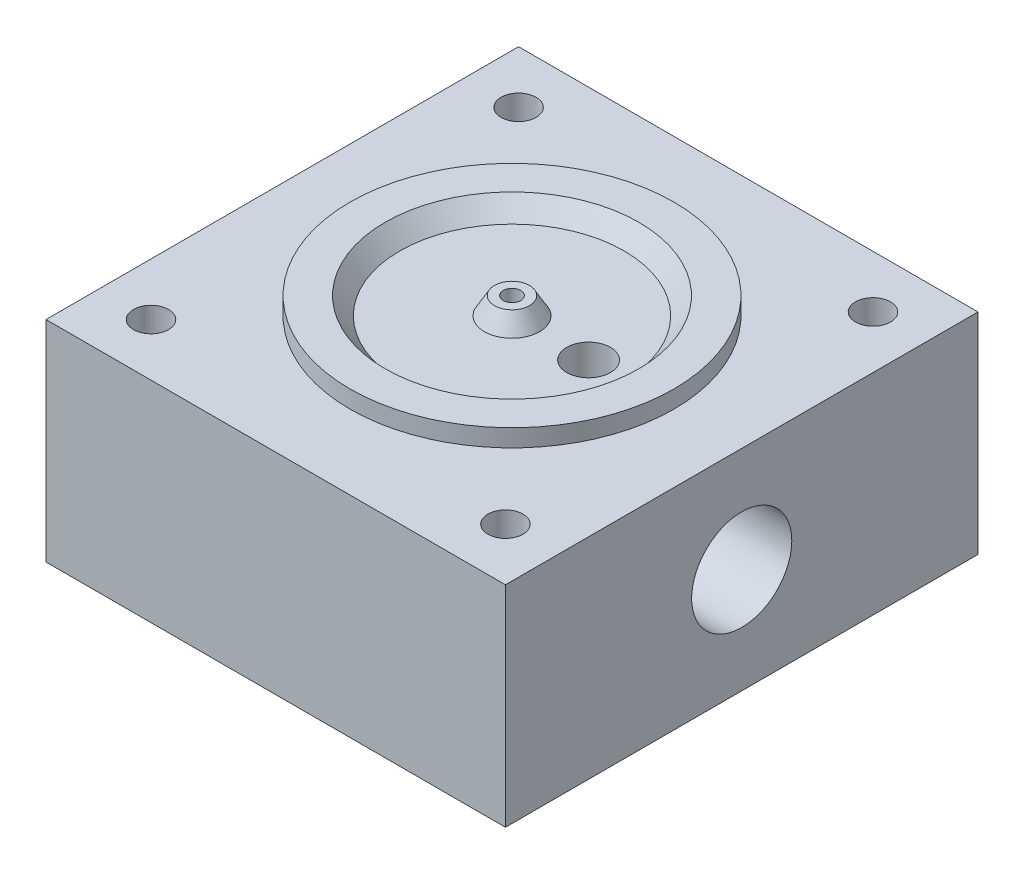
ISO-10303-21;
HEADER;
FILE_DESCRIPTION(('STEP AP214'),'2;1');
FILE_NAME('part.step','',(''),(''),'','','');
FILE_SCHEMA(('AUTOMOTIVE_DESIGN { 1 0 10303 214 1 1 1 1 }'));
ENDSEC;
DATA;
#1=APPLICATION_CONTEXT('core data for automotive mechanical design processes');
#2=APPLICATION_PROTOCOL_DEFINITION('international standard','automotive_design',2000,#1);
#3=PRODUCT_CONTEXT('',#1,'mechanical');
#4=PRODUCT('Part','Part','',(#3));
#5=PRODUCT_RELATED_PRODUCT_CATEGORY('part','',(#4));
#6=PRODUCT_DEFINITION_FORMATION('','',#4);
#7=PRODUCT_DEFINITION_CONTEXT('part definition',#1,'design');
#8=PRODUCT_DEFINITION('design','',#6,#7);
#9=PRODUCT_DEFINITION_SHAPE('','',#8);
#10=(LENGTH_UNIT() NAMED_UNIT(*) SI_UNIT(.MILLI.,.METRE.));
#11=(NAMED_UNIT(*) PLANE_ANGLE_UNIT() SI_UNIT($,.RADIAN.));
#12=(NAMED_UNIT(*) SI_UNIT($,.STERADIAN.) SOLID_ANGLE_UNIT());
#13=UNCERTAINTY_MEASURE_WITH_UNIT(LENGTH_MEASURE(1.E-05),#10,'distance_accuracy_value','');
#14=(GEOMETRIC_REPRESENTATION_CONTEXT(3) GLOBAL_UNCERTAINTY_ASSIGNED_CONTEXT((#13)) GLOBAL_UNIT_ASSIGNED_CONTEXT((#10,
#11,#12)) REPRESENTATION_CONTEXT('',''));
#15=CARTESIAN_POINT('',(0.,0.,0.));
#16=DIRECTION('',(0.,0.,1.));
#17=DIRECTION('',(1.,0.,0.));
#18=AXIS2_PLACEMENT_3D('',#15,#16,#17);
#19=CARTESIAN_POINT('',(0.,24.,-54.));
#20=DIRECTION('',(0.,1.,0.));
#21=DIRECTION('',(0.,0.,1.));
#22=AXIS2_PLACEMENT_3D('',#19,#20,#21);
#23=PLANE('',#22);
#24=CARTESIAN_POINT('',(46.5,24.,-48.));
#25=DIRECTION('',(0.,1.,0.));
#26=DIRECTION('',(0.,0.,-1.));
#27=AXIS2_PLACEMENT_3D('',#24,#25,#26);
#28=CIRCLE('',#27,2.);
#29=CARTESIAN_POINT('',(46.5,24.,-50.));
#30=VERTEX_POINT('',#29);
#31=EDGE_CURVE('E282',#30,#30,#28,.T.);
#32=ORIENTED_EDGE('',*,*,#31,.F.);
#33=EDGE_LOOP('',(#32));
#34=FACE_BOUND('',#33,.T.);
#35=CARTESIAN_POINT('',(6.,24.,-48.));
#36=DIRECTION('',(0.,-1.,0.));
#37=DIRECTION('',(0.,0.,-1.));
#38=AXIS2_PLACEMENT_3D('',#35,#36,#37);
#39=CIRCLE('',#38,2.);
#40=CARTESIAN_POINT('',(6.,24.,-50.));
#41=VERTEX_POINT('',#40);
#42=EDGE_CURVE('E292',#41,#41,#39,.T.);
#43=ORIENTED_EDGE('',*,*,#42,.T.);
#44=EDGE_LOOP('',(#43));
#45=FACE_BOUND('',#44,.T.);
#46=CARTESIAN_POINT('',(6.,24.,-6.));
#47=DIRECTION('',(0.,1.,0.));
#48=DIRECTION('',(0.,0.,1.));
#49=AXIS2_PLACEMENT_3D('',#46,#47,#48);
#50=CIRCLE('',#49,2.);
#51=CARTESIAN_POINT('',(6.,24.,-4.));
#52=VERTEX_POINT('',#51);
#53=EDGE_CURVE('E251',#52,#52,#50,.T.);
#54=ORIENTED_EDGE('',*,*,#53,.F.);
#55=EDGE_LOOP('',(#54));
#56=FACE_BOUND('',#55,.T.);
#57=DIRECTION('',(-1.,0.,0.));
#58=VECTOR('',#57,1.);
#59=CARTESIAN_POINT('',(0.,24.,0.));
#60=LINE('',#59,#58);
#61=CARTESIAN_POINT('',(52.5,24.,0.));
#62=VERTEX_POINT('',#61);
#63=CARTESIAN_POINT('',(0.,24.,0.));
#64=VERTEX_POINT('',#63);
#65=EDGE_CURVE('E120',#62,#64,#60,.T.);
#66=ORIENTED_EDGE('',*,*,#65,.F.);
#67=DIRECTION('',(0.,0.,1.));
#68=VECTOR('',#67,1.);
#69=CARTESIAN_POINT('',(52.5,24.,-54.));
#70=LINE('',#69,#68);
#71=CARTESIAN_POINT('',(52.5,24.,-54.));
#72=VERTEX_POINT('',#71);
#73=EDGE_CURVE('E40',#72,#62,#70,.T.);
#74=ORIENTED_EDGE('',*,*,#73,.F.);
#75=DIRECTION('',(-1.,0.,0.));
#76=VECTOR('',#75,1.);
#77=CARTESIAN_POINT('',(0.,24.,-54.));
#78=LINE('',#77,#76);
#79=CARTESIAN_POINT('',(0.,24.,-54.));
#80=VERTEX_POINT('',#79);
#81=EDGE_CURVE('E131',#72,#80,#78,.T.);
#82=ORIENTED_EDGE('',*,*,#81,.T.);
#83=DIRECTION('',(0.,0.,1.));
#84=VECTOR('',#83,1.);
#85=CARTESIAN_POINT('',(0.,24.,-54.));
#86=LINE('',#85,#84);
#87=EDGE_CURVE('E11',#80,#64,#86,.T.);
#88=ORIENTED_EDGE('',*,*,#87,.T.);
#89=EDGE_LOOP('',(#66,#74,#82,#88));
#90=FACE_BOUND('',#89,.T.);
#91=CARTESIAN_POINT('',(26.25,24.,-27.));
#92=DIRECTION('',(0.,1.,0.));
#93=DIRECTION('',(0.,0.,1.));
#94=AXIS2_PLACEMENT_3D('',#91,#92,#93);
#95=CIRCLE('',#94,18.5);
#96=CARTESIAN_POINT('',(26.25,24.,-8.5));
#97=VERTEX_POINT('',#96);
#98=EDGE_CURVE('E105',#97,#97,#95,.T.);
#99=ORIENTED_EDGE('',*,*,#98,.F.);
#100=EDGE_LOOP('',(#99));
#101=FACE_BOUND('',#100,.T.);
#102=CARTESIAN_POINT('',(46.5,24.,-6.));
#103=DIRECTION('',(0.,-1.,0.));
#104=DIRECTION('',(0.,0.,1.));
#105=AXIS2_PLACEMENT_3D('',#102,#103,#104);
#106=CIRCLE('',#105,2.);
#107=CARTESIAN_POINT('',(46.5,24.,-4.));
#108=VERTEX_POINT('',#107);
#109=EDGE_CURVE('E284',#108,#108,#106,.T.);
#110=ORIENTED_EDGE('',*,*,#109,.T.);
#111=EDGE_LOOP('',(#110));
#112=FACE_BOUND('',#111,.T.);
#113=ADVANCED_FACE('F31',(#34,#45,#56,#90,#101,#112),#23,.T.);
#114=CARTESIAN_POINT('',(0.,0.,-54.));
#115=DIRECTION('',(0.,-1.,0.));
#116=DIRECTION('',(0.,0.,-1.));
#117=AXIS2_PLACEMENT_3D('',#114,#115,#116);
#118=PLANE('',#117);
#119=CARTESIAN_POINT('',(46.5,0.,-48.));
#120=DIRECTION('',(0.,1.,0.));
#121=DIRECTION('',(0.,0.,-1.));
#122=AXIS2_PLACEMENT_3D('',#119,#120,#121);
#123=CIRCLE('',#122,2.);
#124=CARTESIAN_POINT('',(46.5,0.,-50.));
#125=VERTEX_POINT('',#124);
#126=EDGE_CURVE('E280',#125,#125,#123,.T.);
#127=ORIENTED_EDGE('',*,*,#126,.T.);
#128=EDGE_LOOP('',(#127));
#129=FACE_BOUND('',#128,.T.);
#130=CARTESIAN_POINT('',(6.,0.,-48.));
#131=DIRECTION('',(0.,-1.,0.));
#132=DIRECTION('',(0.,0.,-1.));
#133=AXIS2_PLACEMENT_3D('',#130,#131,#132);
#134=CIRCLE('',#133,2.);
#135=CARTESIAN_POINT('',(6.,0.,-50.));
#136=VERTEX_POINT('',#135);
#137=EDGE_CURVE('E295',#136,#136,#134,.T.);
#138=ORIENTED_EDGE('',*,*,#137,.F.);
#139=EDGE_LOOP('',(#138));
#140=FACE_BOUND('',#139,.T.);
#141=CARTESIAN_POINT('',(6.,0.,-6.));
#142=DIRECTION('',(0.,1.,0.));
#143=DIRECTION('',(0.,0.,1.));
#144=AXIS2_PLACEMENT_3D('',#141,#142,#143);
#145=CIRCLE('',#144,2.);
#146=CARTESIAN_POINT('',(6.,0.,-4.));
#147=VERTEX_POINT('',#146);
#148=EDGE_CURVE('E248',#147,#147,#145,.T.);
#149=ORIENTED_EDGE('',*,*,#148,.T.);
#150=EDGE_LOOP('',(#149));
#151=FACE_BOUND('',#150,.T.);
#152=DIRECTION('',(1.,0.,0.));
#153=VECTOR('',#152,1.);
#154=CARTESIAN_POINT('',(0.,0.,0.));
#155=LINE('',#154,#153);
#156=CARTESIAN_POINT('',(0.,0.,0.));
#157=VERTEX_POINT('',#156);
#158=CARTESIAN_POINT('',(52.5,0.,0.));
#159=VERTEX_POINT('',#158);
#160=EDGE_CURVE('E114',#157,#159,#155,.T.);
#161=ORIENTED_EDGE('',*,*,#160,.F.);
#162=DIRECTION('',(0.,0.,1.));
#163=VECTOR('',#162,1.);
#164=CARTESIAN_POINT('',(0.,0.,-54.));
#165=LINE('',#164,#163);
#166=CARTESIAN_POINT('',(0.,0.,-54.));
#167=VERTEX_POINT('',#166);
#168=EDGE_CURVE('E35',#167,#157,#165,.T.);
#169=ORIENTED_EDGE('',*,*,#168,.F.);
#170=DIRECTION('',(1.,0.,0.));
#171=VECTOR('',#170,1.);
#172=CARTESIAN_POINT('',(0.,0.,-54.));
#173=LINE('',#172,#171);
#174=CARTESIAN_POINT('',(52.5,0.,-54.));
#175=VERTEX_POINT('',#174);
#176=EDGE_CURVE('E125',#167,#175,#173,.T.);
#177=ORIENTED_EDGE('',*,*,#176,.T.);
#178=DIRECTION('',(0.,0.,1.));
#179=VECTOR('',#178,1.);
#180=CARTESIAN_POINT('',(52.5,0.,-54.));
#181=LINE('',#180,#179);
#182=EDGE_CURVE('E134',#175,#159,#181,.T.);
#183=ORIENTED_EDGE('',*,*,#182,.T.);
#184=EDGE_LOOP('',(#161,#169,#177,#183));
#185=FACE_BOUND('',#184,.T.);
#186=CARTESIAN_POINT('',(46.5,0.,-6.));
#187=DIRECTION('',(0.,-1.,0.));
#188=DIRECTION('',(0.,0.,1.));
#189=AXIS2_PLACEMENT_3D('',#186,#187,#188);
#190=CIRCLE('',#189,2.);
#191=CARTESIAN_POINT('',(46.5,0.,-4.));
#192=VERTEX_POINT('',#191);
#193=EDGE_CURVE('E289',#192,#192,#190,.T.);
#194=ORIENTED_EDGE('',*,*,#193,.F.);
#195=EDGE_LOOP('',(#194));
#196=FACE_BOUND('',#195,.T.);
#197=ADVANCED_FACE('F139',(#129,#140,#151,#185,#196),#118,.T.);
#198=CARTESIAN_POINT('',(26.25,26.,-27.));
#199=DIRECTION('',(0.,1.,0.));
#200=DIRECTION('',(0.,0.,1.));
#201=AXIS2_PLACEMENT_3D('',#198,#199,#200);
#202=PLANE('',#201);
#203=CARTESIAN_POINT('',(26.25,26.,-27.));
#204=DIRECTION('',(0.,1.,0.));
#205=DIRECTION('',(0.,0.,1.));
#206=AXIS2_PLACEMENT_3D('',#203,#204,#205);
#207=CIRCLE('',#206,18.5);
#208=CARTESIAN_POINT('',(26.25,26.,-8.5));
#209=VERTEX_POINT('',#208);
#210=EDGE_CURVE('E108',#209,#209,#207,.T.);
#211=ORIENTED_EDGE('',*,*,#210,.T.);
#212=EDGE_LOOP('',(#211));
#213=FACE_BOUND('',#212,.T.);
#214=CARTESIAN_POINT('',(26.25,26.,-27.));
#215=DIRECTION('',(0.,1.,0.));
#216=DIRECTION('',(0.,0.,1.));
#217=AXIS2_PLACEMENT_3D('',#214,#215,#216);
#218=CIRCLE('',#217,14.5);
#219=CARTESIAN_POINT('',(26.25,26.,-12.5));
#220=VERTEX_POINT('',#219);
#221=EDGE_CURVE('E90',#220,#220,#218,.T.);
#222=ORIENTED_EDGE('',*,*,#221,.F.);
#223=EDGE_LOOP('',(#222));
#224=FACE_BOUND('',#223,.T.);
#225=ADVANCED_FACE('F160',(#213,#224),#202,.T.);
#226=CARTESIAN_POINT('',(0.,0.,-54.));
#227=DIRECTION('',(-1.,0.,0.));
#228=DIRECTION('',(0.,0.,1.));
#229=AXIS2_PLACEMENT_3D('',#226,#227,#228);
#230=PLANE('',#229);
#231=CARTESIAN_POINT('',(0.,12.,-27.));
#232=DIRECTION('',(-1.,0.,0.));
#233=DIRECTION('',(0.,0.,1.));
#234=AXIS2_PLACEMENT_3D('',#231,#232,#233);
#235=CIRCLE('',#234,5.7225);
#236=CARTESIAN_POINT('',(0.,12.,-21.2775));
#237=VERTEX_POINT('',#236);
#238=EDGE_CURVE('E239',#237,#237,#235,.T.);
#239=ORIENTED_EDGE('',*,*,#238,.F.);
#240=EDGE_LOOP('',(#239));
#241=FACE_BOUND('',#240,.T.);
#242=DIRECTION('',(0.,-1.,0.));
#243=VECTOR('',#242,1.);
#244=CARTESIAN_POINT('',(0.,0.,0.));
#245=LINE('',#244,#243);
#246=EDGE_CURVE('E111',#64,#157,#245,.T.);
#247=ORIENTED_EDGE('',*,*,#246,.F.);
#248=ORIENTED_EDGE('',*,*,#87,.F.);
#249=DIRECTION('',(0.,-1.,0.));
#250=VECTOR('',#249,1.);
#251=CARTESIAN_POINT('',(0.,0.,-54.));
#252=LINE('',#251,#250);
#253=EDGE_CURVE('E123',#80,#167,#252,.T.);
#254=ORIENTED_EDGE('',*,*,#253,.T.);
#255=ORIENTED_EDGE('',*,*,#168,.T.);
#256=EDGE_LOOP('',(#247,#248,#254,#255));
#257=FACE_BOUND('',#256,.T.);
#258=ADVANCED_FACE('F33',(#241,#257),#230,.T.);
#259=CARTESIAN_POINT('',(52.5,0.,-54.));
#260=DIRECTION('',(1.,0.,0.));
#261=DIRECTION('',(0.,0.,-1.));
#262=AXIS2_PLACEMENT_3D('',#259,#260,#261);
#263=PLANE('',#262);
#264=CARTESIAN_POINT('',(52.5,12.,-27.));
#265=DIRECTION('',(1.,0.,0.));
#266=DIRECTION('',(0.,0.,-1.));
#267=AXIS2_PLACEMENT_3D('',#264,#265,#266);
#268=CIRCLE('',#267,5.7225);
#269=CARTESIAN_POINT('',(52.5,12.,-32.7225));
#270=VERTEX_POINT('',#269);
#271=EDGE_CURVE('E233',#270,#270,#268,.T.);
#272=ORIENTED_EDGE('',*,*,#271,.F.);
#273=EDGE_LOOP('',(#272));
#274=FACE_BOUND('',#273,.T.);
#275=DIRECTION('',(0.,1.,0.));
#276=VECTOR('',#275,1.);
#277=CARTESIAN_POINT('',(52.5,0.,0.));
#278=LINE('',#277,#276);
#279=EDGE_CURVE('E117',#159,#62,#278,.T.);
#280=ORIENTED_EDGE('',*,*,#279,.F.);
#281=ORIENTED_EDGE('',*,*,#182,.F.);
#282=DIRECTION('',(0.,1.,0.));
#283=VECTOR('',#282,1.);
#284=CARTESIAN_POINT('',(52.5,0.,-54.));
#285=LINE('',#284,#283);
#286=EDGE_CURVE('E128',#175,#72,#285,.T.);
#287=ORIENTED_EDGE('',*,*,#286,.T.);
#288=ORIENTED_EDGE('',*,*,#73,.T.);
#289=EDGE_LOOP('',(#280,#281,#287,#288));
#290=FACE_BOUND('',#289,.T.);
#291=ADVANCED_FACE('F151',(#274,#290),#263,.T.);
#292=CARTESIAN_POINT('',(0.,24.,-54.));
#293=DIRECTION('',(0.,0.,-1.));
#294=DIRECTION('',(-1.,0.,0.));
#295=AXIS2_PLACEMENT_3D('',#292,#293,#294);
#296=PLANE('',#295);
#297=ORIENTED_EDGE('',*,*,#253,.F.);
#298=ORIENTED_EDGE('',*,*,#81,.F.);
#299=ORIENTED_EDGE('',*,*,#286,.F.);
#300=ORIENTED_EDGE('',*,*,#176,.F.);
#301=EDGE_LOOP('',(#297,#298,#299,#300));
#302=FACE_BOUND('',#301,.T.);
#303=ADVANCED_FACE('F149',(#302),#296,.T.);
#304=CARTESIAN_POINT('',(0.,24.,0.));
#305=DIRECTION('',(0.,0.,-1.));
#306=DIRECTION('',(-1.,0.,0.));
#307=AXIS2_PLACEMENT_3D('',#304,#305,#306);
#308=PLANE('',#307);
#309=ORIENTED_EDGE('',*,*,#246,.T.);
#310=ORIENTED_EDGE('',*,*,#160,.T.);
#311=ORIENTED_EDGE('',*,*,#279,.T.);
#312=ORIENTED_EDGE('',*,*,#65,.T.);
#313=EDGE_LOOP('',(#309,#310,#311,#312));
#314=FACE_BOUND('',#313,.T.);
#315=ADVANCED_FACE('F142',(#314),#308,.F.);
#316=CARTESIAN_POINT('',(26.25,26.,-27.));
#317=DIRECTION('',(0.,-1.,0.));
#318=DIRECTION('',(0.,0.,-1.));
#319=AXIS2_PLACEMENT_3D('',#316,#317,#318);
#320=CYLINDRICAL_SURFACE('',#319,18.5);
#321=ORIENTED_EDGE('',*,*,#210,.F.);
#322=EDGE_LOOP('',(#321));
#323=FACE_BOUND('',#322,.T.);
#324=ORIENTED_EDGE('',*,*,#98,.T.);
#325=EDGE_LOOP('',(#324));
#326=FACE_BOUND('',#325,.T.);
#327=ADVANCED_FACE('F175',(#323,#326),#320,.T.);
#328=CARTESIAN_POINT('',(39.0718007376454,24.,-27.));
#329=DIRECTION('',(0.,1.,0.));
#330=DIRECTION('',(0.,0.,1.));
#331=AXIS2_PLACEMENT_3D('',#328,#329,#330);
#332=PLANE('',#331);
#333=CARTESIAN_POINT('',(35.,24.,-27.));
#334=DIRECTION('',(0.,1.,0.));
#335=DIRECTION('',(0.,0.,1.));
#336=AXIS2_PLACEMENT_3D('',#333,#334,#335);
#337=CIRCLE('',#336,2.5);
#338=CARTESIAN_POINT('',(35.,24.,-24.5));
#339=VERTEX_POINT('',#338);
#340=EDGE_CURVE('E229',#339,#339,#337,.T.);
#341=ORIENTED_EDGE('',*,*,#340,.F.);
#342=EDGE_LOOP('',(#341));
#343=FACE_BOUND('',#342,.T.);
#344=CARTESIAN_POINT('',(26.25,24.,-27.));
#345=DIRECTION('',(0.,1.,0.));
#346=DIRECTION('',(0.,0.,1.));
#347=AXIS2_PLACEMENT_3D('',#344,#345,#346);
#348=CIRCLE('',#347,12.8218007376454);
#349=CARTESIAN_POINT('',(26.25,24.,-14.1781992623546));
#350=VERTEX_POINT('',#349);
#351=EDGE_CURVE('E86',#350,#350,#348,.T.);
#352=ORIENTED_EDGE('',*,*,#351,.T.);
#353=EDGE_LOOP('',(#352));
#354=FACE_BOUND('',#353,.T.);
#355=CARTESIAN_POINT('',(26.25,24.,-27.));
#356=DIRECTION('',(0.,1.,0.));
#357=DIRECTION('',(0.,0.,1.));
#358=AXIS2_PLACEMENT_3D('',#355,#356,#357);
#359=CIRCLE('',#358,3.15470053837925);
#360=CARTESIAN_POINT('',(26.25,24.,-23.8452994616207));
#361=VERTEX_POINT('',#360);
#362=EDGE_CURVE('E102',#361,#361,#359,.T.);
#363=ORIENTED_EDGE('',*,*,#362,.F.);
#364=EDGE_LOOP('',(#363));
#365=FACE_BOUND('',#364,.T.);
#366=ADVANCED_FACE('F178',(#343,#354,#365),#332,.T.);
#367=CARTESIAN_POINT('',(26.25,26.,-27.));
#368=DIRECTION('',(0.,-1.,0.));
#369=DIRECTION('',(0.,0.,-1.));
#370=AXIS2_PLACEMENT_3D('',#367,#368,#369);
#371=CONICAL_SURFACE('',#370,2.,0.523598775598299);
#372=ORIENTED_EDGE('',*,*,#362,.T.);
#373=EDGE_LOOP('',(#372));
#374=FACE_BOUND('',#373,.T.);
#375=CARTESIAN_POINT('',(26.25,26.,-27.));
#376=DIRECTION('',(0.,1.,0.));
#377=DIRECTION('',(0.,0.,1.));
#378=AXIS2_PLACEMENT_3D('',#375,#376,#377);
#379=CIRCLE('',#378,2.);
#380=CARTESIAN_POINT('',(26.25,26.,-25.));
#381=VERTEX_POINT('',#380);
#382=EDGE_CURVE('E99',#381,#381,#379,.T.);
#383=ORIENTED_EDGE('',*,*,#382,.F.);
#384=EDGE_LOOP('',(#383));
#385=FACE_BOUND('',#384,.T.);
#386=ADVANCED_FACE('F186',(#374,#385),#371,.T.);
#387=CARTESIAN_POINT('',(26.25,24.,-27.));
#388=DIRECTION('',(0.,1.,0.));
#389=DIRECTION('',(0.,0.,1.));
#390=AXIS2_PLACEMENT_3D('',#387,#388,#389);
#391=CONICAL_SURFACE('',#390,12.8218007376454,0.698131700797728);
#392=ORIENTED_EDGE('',*,*,#221,.T.);
#393=EDGE_LOOP('',(#392));
#394=FACE_BOUND('',#393,.T.);
#395=ORIENTED_EDGE('',*,*,#351,.F.);
#396=EDGE_LOOP('',(#395));
#397=FACE_BOUND('',#396,.T.);
#398=ADVANCED_FACE('F182',(#394,#397),#391,.F.);
#399=CARTESIAN_POINT('',(26.25,26.,-27.));
#400=DIRECTION('',(0.,1.,0.));
#401=DIRECTION('',(0.,0.,1.));
#402=AXIS2_PLACEMENT_3D('',#399,#400,#401);
#403=CIRCLE('',#402,1.);
#404=CARTESIAN_POINT('',(26.25,26.,-26.));
#405=VERTEX_POINT('',#404);
#406=EDGE_CURVE('E228',#405,#405,#403,.T.);
#407=ORIENTED_EDGE('',*,*,#406,.F.);
#408=EDGE_LOOP('',(#407));
#409=FACE_BOUND('',#408,.T.);
#410=ORIENTED_EDGE('',*,*,#382,.T.);
#411=EDGE_LOOP('',(#410));
#412=FACE_BOUND('',#411,.T.);
#413=ADVANCED_FACE('F80',(#409,#412),#202,.T.);
#414=CARTESIAN_POINT('',(27.5,12.,-27.));
#415=DIRECTION('',(-1.,0.,0.));
#416=DIRECTION('',(0.,0.,1.));
#417=AXIS2_PLACEMENT_3D('',#414,#415,#416);
#418=CONICAL_SURFACE('',#417,2.,1.02974425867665);
#419=CARTESIAN_POINT('',(28.7017212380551,12.,-27.));
#420=VERTEX_POINT('',#419);
#421=VERTEX_LOOP('',#420);
#422=FACE_BOUND('',#421,.T.);
#423=CARTESIAN_POINT('',(27.5,12.,-27.));
#424=DIRECTION('',(-1.,0.,0.));
#425=DIRECTION('',(0.,0.,1.));
#426=AXIS2_PLACEMENT_3D('',#423,#424,#425);
#427=CIRCLE('',#426,2.);
#428=CARTESIAN_POINT('',(27.5,12.,-25.));
#429=VERTEX_POINT('',#428);
#430=EDGE_CURVE('E84',#429,#429,#427,.T.);
#431=ORIENTED_EDGE('',*,*,#430,.T.);
#432=EDGE_LOOP('',(#431));
#433=FACE_BOUND('',#432,.T.);
#434=ADVANCED_FACE('F76',(#422,#433),#418,.F.);
#435=CARTESIAN_POINT('',(0.,12.,-27.));
#436=DIRECTION('',(-1.,0.,0.));
#437=DIRECTION('',(0.,0.,1.));
#438=AXIS2_PLACEMENT_3D('',#435,#436,#437);
#439=CYLINDRICAL_SURFACE('',#438,2.);
#440=CARTESIAN_POINT('',(26.25,13.7320508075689,-26.));
#441=CARTESIAN_POINT('',(26.1978921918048,13.7320553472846,-26.0000036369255));
#442=CARTESIAN_POINT('',(26.145718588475,13.7344380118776,-26.0041000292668));
#443=CARTESIAN_POINT('',(26.0429727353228,13.7436236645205,-26.0202767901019));
#444=CARTESIAN_POINT('',(25.9924040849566,13.7504359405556,-26.0323739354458));
#445=CARTESIAN_POINT('',(25.8945483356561,13.767493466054,-26.0639000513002));
#446=CARTESIAN_POINT('',(25.8472453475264,13.7777204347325,-26.0832900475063));
#447=CARTESIAN_POINT('',(25.7565757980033,13.8004266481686,-26.1287324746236));
#448=CARTESIAN_POINT('',(25.7132094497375,13.8129060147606,-26.1547852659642));
#449=CARTESIAN_POINT('',(25.6276942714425,13.8399686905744,-26.2153334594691));
#450=CARTESIAN_POINT('',(25.5859408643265,13.8546406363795,-26.2503479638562));
#451=CARTESIAN_POINT('',(25.5085916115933,13.8837198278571,-26.3267461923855));
#452=CARTESIAN_POINT('',(25.4729988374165,13.8981269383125,-26.3681330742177));
#453=CARTESIAN_POINT('',(25.4066328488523,13.9262147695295,-26.4595104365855));
#454=CARTESIAN_POINT('',(25.3763462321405,13.9397810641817,-26.5098928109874));
#455=CARTESIAN_POINT('',(25.3248591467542,13.9635075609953,-26.6158429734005));
#456=CARTESIAN_POINT('',(25.3036529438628,13.9736699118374,-26.6714074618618));
#457=CARTESIAN_POINT('',(25.2724953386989,13.9888046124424,-26.781955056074));
#458=CARTESIAN_POINT('',(25.2618504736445,13.9940948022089,-26.8366982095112));
#459=CARTESIAN_POINT('',(25.249833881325,14.0000758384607,-26.9474293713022));
#460=CARTESIAN_POINT('',(25.2484565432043,14.0007694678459,-27.0034166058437));
#461=CARTESIAN_POINT('',(25.2547466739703,13.9976298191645,-27.1098325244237));
#462=CARTESIAN_POINT('',(25.2616380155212,13.9941849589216,-27.1603211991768));
#463=CARTESIAN_POINT('',(25.2828808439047,13.9837424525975,-27.2593137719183));
#464=CARTESIAN_POINT('',(25.2972328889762,13.9767445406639,-27.3078175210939));
#465=CARTESIAN_POINT('',(25.3330825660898,13.9597158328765,-27.4023093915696));
#466=CARTESIAN_POINT('',(25.3546763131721,13.949644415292,-27.4482534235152));
#467=CARTESIAN_POINT('',(25.4042634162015,13.9273764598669,-27.5359768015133));
#468=CARTESIAN_POINT('',(25.4322590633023,13.9151791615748,-27.5777546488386));
#469=CARTESIAN_POINT('',(25.496895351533,13.8884439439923,-27.6601736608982));
#470=CARTESIAN_POINT('',(25.534103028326,13.8737937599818,-27.7003340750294));
#471=CARTESIAN_POINT('',(25.6145897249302,13.8445434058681,-27.7741043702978));
#472=CARTESIAN_POINT('',(25.6578733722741,13.8299432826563,-27.8077092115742));
#473=CARTESIAN_POINT('',(25.7526481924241,13.8014415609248,-27.8695053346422));
#474=CARTESIAN_POINT('',(25.8044860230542,13.7876431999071,-27.8972173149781));
#475=CARTESIAN_POINT('',(25.912937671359,13.7637545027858,-27.9433191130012));
#476=CARTESIAN_POINT('',(25.9695464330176,13.7536603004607,-27.9617186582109));
#477=CARTESIAN_POINT('',(26.0812145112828,13.7394463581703,-27.987180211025));
#478=CARTESIAN_POINT('',(26.1360411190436,13.734916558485,-27.99502512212));
#479=CARTESIAN_POINT('',(26.2464013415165,13.7311791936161,-28.0015169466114));
#480=CARTESIAN_POINT('',(26.3019344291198,13.7319678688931,-28.000170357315));
#481=CARTESIAN_POINT('',(26.4056539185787,13.7383433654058,-27.989036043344));
#482=CARTESIAN_POINT('',(26.4539794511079,13.7433958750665,-27.9801878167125));
#483=CARTESIAN_POINT('',(26.548367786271,13.7569402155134,-27.9556962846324));
#484=CARTESIAN_POINT('',(26.5944298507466,13.7654331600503,-27.9400507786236));
#485=CARTESIAN_POINT('',(26.6854113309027,13.7853622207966,-27.9016475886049));
#486=CARTESIAN_POINT('',(26.7301790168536,13.7969164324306,-27.8785940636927));
#487=CARTESIAN_POINT('',(26.815469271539,13.8215611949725,-27.8262870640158));
#488=CARTESIAN_POINT('',(26.8559896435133,13.8346525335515,-27.7970304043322));
#489=CARTESIAN_POINT('',(26.9369787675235,13.8628799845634,-27.7288371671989));
#490=CARTESIAN_POINT('',(26.9767971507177,13.8780658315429,-27.689145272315));
#491=CARTESIAN_POINT('',(27.0494122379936,13.9073423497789,-27.6034044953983));
#492=CARTESIAN_POINT('',(27.0822065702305,13.9214326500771,-27.5573534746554));
#493=CARTESIAN_POINT('',(27.1405737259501,13.9474136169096,-27.4585353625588));
#494=CARTESIAN_POINT('',(27.1659331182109,13.9592364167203,-27.4056230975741));
#495=CARTESIAN_POINT('',(27.2071379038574,13.978833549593,-27.2955223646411));
#496=CARTESIAN_POINT('',(27.2229916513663,13.9866114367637,-27.2383377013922));
#497=CARTESIAN_POINT('',(27.2433685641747,13.9966750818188,-27.1269796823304));
#498=CARTESIAN_POINT('',(27.2487978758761,13.9993992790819,-27.0730114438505));
#499=CARTESIAN_POINT('',(27.2508432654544,14.0004213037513,-26.9648740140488));
#500=CARTESIAN_POINT('',(27.2474624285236,13.9987206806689,-26.9107048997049));
#501=CARTESIAN_POINT('',(27.2325835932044,13.9913396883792,-26.8074620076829));
#502=CARTESIAN_POINT('',(27.2216351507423,13.9859289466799,-26.7582876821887));
#503=CARTESIAN_POINT('',(27.192673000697,13.9719209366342,-26.6625540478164));
#504=CARTESIAN_POINT('',(27.1746582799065,13.963323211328,-26.6159951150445));
#505=CARTESIAN_POINT('',(27.131272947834,13.9432593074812,-26.5245765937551));
#506=CARTESIAN_POINT('',(27.1056206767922,13.931686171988,-26.4798748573));
#507=CARTESIAN_POINT('',(27.048042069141,13.9068813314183,-26.395225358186));
#508=CARTESIAN_POINT('',(27.0161128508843,13.8936488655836,-26.3552797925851));
#509=CARTESIAN_POINT('',(26.9432028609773,13.8652861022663,-26.2770859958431));
#510=CARTESIAN_POINT('',(26.9016375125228,13.850097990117,-26.2394023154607));
#511=CARTESIAN_POINT('',(26.8125492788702,13.8206307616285,-26.1713367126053));
#512=CARTESIAN_POINT('',(26.7650211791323,13.8063524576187,-26.1409612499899));
#513=CARTESIAN_POINT('',(26.663363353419,13.7799960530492,-26.0875689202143));
#514=CARTESIAN_POINT('',(26.6090724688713,13.7680017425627,-26.0648149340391));
#515=CARTESIAN_POINT('',(26.4966675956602,13.7486615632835,-26.0291212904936));
#516=CARTESIAN_POINT('',(26.4385671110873,13.741300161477,-26.0161488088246));
#517=CARTESIAN_POINT('',(26.358194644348,13.7352927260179,-26.0056329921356));
#518=CARTESIAN_POINT('',(26.3366321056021,13.7340812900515,-26.0035238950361));
#519=CARTESIAN_POINT('',(26.2933835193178,13.7324593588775,-26.00070659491));
#520=CARTESIAN_POINT('',(26.2716974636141,13.7320489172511,-25.9999984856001));
#521=CARTESIAN_POINT('',(26.25,13.7320508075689,-26.));
#522=B_SPLINE_CURVE_WITH_KNOTS('',3,(#440,#441,#442,#443,#444,#445,#446,#447,#448,#449,#450,
#451,#452,#453,#454,#455,#456,#457,#458,#459,#460,#461,#462,#463,#464,#465,#466,#467,#468,#469,
#470,#471,#472,#473,#474,#475,#476,#477,#478,#479,#480,#481,#482,#483,#484,#485,#486,#487,#488,
#489,#490,#491,#492,#493,#494,#495,#496,#497,#498,#499,#500,#501,#502,#503,#504,#505,#506,#507,
#508,#509,#510,#511,#512,#513,#514,#515,#516,#517,#518,#519,#520,#521),.UNSPECIFIED.,.T.,.F.,(4,
2,2,2,2,2,2,2,2,2,2,2,2,2,2,2,2,2,2,2,2,2,2,2,2,2,2,2,2,2,2,2,2,2,2,2,2,2,2,2,4),(0.,
0.156232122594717,0.312792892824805,0.468528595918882,0.624272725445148,0.792862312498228,
0.961535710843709,1.14157892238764,1.32150826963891,1.48863484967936,1.6556602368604,
1.80816097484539,1.96067312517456,2.11529534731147,2.26997299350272,2.43927191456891,
2.60870048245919,2.78888841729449,2.96888774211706,3.13462290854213,3.30024093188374,
3.44774183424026,3.59529052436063,3.74967296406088,3.90413486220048,4.07806743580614,
4.25205864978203,4.43064181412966,4.60906779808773,4.77112270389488,4.93312086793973,
5.08444424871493,5.23578933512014,5.39360750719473,5.5514983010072,5.72510241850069,
5.89885942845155,6.07810749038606,6.25675133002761,6.3218013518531,6.38685572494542),.UNSPECIFIED.);
#523=CARTESIAN_POINT('',(26.25,13.7320508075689,-26.));
#524=VERTEX_POINT('',#523);
#525=EDGE_CURVE('E222',#524,#524,#522,.T.);
#526=ORIENTED_EDGE('',*,*,#525,.F.);
#527=EDGE_LOOP('',(#526));
#528=FACE_BOUND('',#527,.T.);
#529=ORIENTED_EDGE('',*,*,#430,.F.);
#530=EDGE_LOOP('',(#529));
#531=FACE_BOUND('',#530,.T.);
#532=CARTESIAN_POINT('',(17.5,12.,-27.));
#533=DIRECTION('',(-1.,0.,0.));
#534=DIRECTION('',(0.,0.,1.));
#535=AXIS2_PLACEMENT_3D('',#532,#533,#534);
#536=CIRCLE('',#535,2.);
#537=CARTESIAN_POINT('',(17.5,12.,-25.));
#538=VERTEX_POINT('',#537);
#539=EDGE_CURVE('E87',#538,#538,#536,.T.);
#540=ORIENTED_EDGE('',*,*,#539,.T.);
#541=EDGE_LOOP('',(#540));
#542=FACE_BOUND('',#541,.T.);
#543=ADVANCED_FACE('F79',(#528,#531,#542),#439,.F.);
#544=CARTESIAN_POINT('',(17.5,14.,-27.));
#545=DIRECTION('',(1.,0.,0.));
#546=DIRECTION('',(0.,0.,-1.));
#547=AXIS2_PLACEMENT_3D('',#544,#545,#546);
#548=PLANE('',#547);
#549=ORIENTED_EDGE('',*,*,#539,.F.);
#550=EDGE_LOOP('',(#549));
#551=FACE_BOUND('',#550,.T.);
#552=CARTESIAN_POINT('',(17.5,12.,-27.));
#553=DIRECTION('',(-1.,0.,0.));
#554=DIRECTION('',(0.,0.,1.));
#555=AXIS2_PLACEMENT_3D('',#552,#553,#554);
#556=CIRCLE('',#555,5.7225);
#557=CARTESIAN_POINT('',(17.5,12.,-21.2775));
#558=VERTEX_POINT('',#557);
#559=EDGE_CURVE('E93',#558,#558,#556,.T.);
#560=ORIENTED_EDGE('',*,*,#559,.T.);
#561=EDGE_LOOP('',(#560));
#562=FACE_BOUND('',#561,.T.);
#563=ADVANCED_FACE('F196',(#551,#562),#548,.F.);
#564=CARTESIAN_POINT('',(0.,12.,-27.));
#565=DIRECTION('',(-1.,0.,0.));
#566=DIRECTION('',(0.,0.,1.));
#567=AXIS2_PLACEMENT_3D('',#564,#565,#566);
#568=CYLINDRICAL_SURFACE('',#567,5.7225);
#569=ORIENTED_EDGE('',*,*,#559,.F.);
#570=EDGE_LOOP('',(#569));
#571=FACE_BOUND('',#570,.T.);
#572=ORIENTED_EDGE('',*,*,#238,.T.);
#573=EDGE_LOOP('',(#572));
#574=FACE_BOUND('',#573,.T.);
#575=ADVANCED_FACE('F200',(#571,#574),#568,.F.);
#576=CARTESIAN_POINT('',(32.5,12.,-27.));
#577=DIRECTION('',(1.,0.,0.));
#578=DIRECTION('',(0.,0.,-1.));
#579=AXIS2_PLACEMENT_3D('',#576,#577,#578);
#580=CYLINDRICAL_SURFACE('',#579,5.7225);
#581=CARTESIAN_POINT('',(32.5,12.,-27.));
#582=DIRECTION('',(1.,0.,0.));
#583=DIRECTION('',(0.,0.,-1.));
#584=AXIS2_PLACEMENT_3D('',#581,#582,#583);
#585=CIRCLE('',#584,5.7225);
#586=CARTESIAN_POINT('',(32.5,17.7225,-27.));
#587=VERTEX_POINT('',#586);
#588=EDGE_CURVE('E236',#587,#587,#585,.T.);
#589=ORIENTED_EDGE('',*,*,#588,.F.);
#590=CARTESIAN_POINT('',(35.,17.1475242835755,-24.5));
#591=CARTESIAN_POINT('',(34.8673556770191,17.1475315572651,-24.5000068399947));
#592=CARTESIAN_POINT('',(34.7344870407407,17.1527258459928,-24.5106242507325));
#593=CARTESIAN_POINT('',(34.4726446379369,17.1728087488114,-24.5526399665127));
#594=CARTESIAN_POINT('',(34.3436818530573,17.1877224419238,-24.5840920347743));
#595=CARTESIAN_POINT('',(34.0939054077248,17.2252098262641,-24.6662904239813));
#596=CARTESIAN_POINT('',(33.9730589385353,17.2477501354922,-24.7169527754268));
#597=CARTESIAN_POINT('',(33.7416129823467,17.2979006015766,-24.8358823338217));
#598=CARTESIAN_POINT('',(33.6310117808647,17.3255099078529,-24.90414658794));
#599=CARTESIAN_POINT('',(33.4155502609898,17.3848019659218,-25.0613437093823));
#600=CARTESIAN_POINT('',(33.3114753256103,17.4166312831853,-25.151298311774));
#601=CARTESIAN_POINT('',(33.1193010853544,17.4795782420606,-25.3471815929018));
#602=CARTESIAN_POINT('',(33.0312083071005,17.5106955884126,-25.4531167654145));
#603=CARTESIAN_POINT('',(32.8693495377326,17.5705244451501,-25.6842590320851));
#604=CARTESIAN_POINT('',(32.7964860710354,17.5990459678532,-25.8101518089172));
#605=CARTESIAN_POINT('',(32.6733168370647,17.6486520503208,-26.0738816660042));
#606=CARTESIAN_POINT('',(32.6230001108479,17.6697402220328,-26.2117129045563));
#607=CARTESIAN_POINT('',(32.5492578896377,17.7010607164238,-26.48714297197));
#608=CARTESIAN_POINT('',(32.5244728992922,17.7118393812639,-26.6243143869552));
#609=CARTESIAN_POINT('',(32.4980856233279,17.7233234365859,-26.9012634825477));
#610=CARTESIAN_POINT('',(32.4964729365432,17.7240333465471,-27.0410399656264));
#611=CARTESIAN_POINT('',(32.5158056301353,17.7156077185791,-27.3092722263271));
#612=CARTESIAN_POINT('',(32.5352517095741,17.7071265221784,-27.437860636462));
#613=CARTESIAN_POINT('',(32.5935544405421,17.6821910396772,-27.6897343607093));
#614=CARTESIAN_POINT('',(32.6324125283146,17.6657361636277,-27.8130192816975));
#615=CARTESIAN_POINT('',(32.7288687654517,17.6261076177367,-28.0530709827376));
#616=CARTESIAN_POINT('',(32.7867443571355,17.6028350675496,-28.16970928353));
#617=CARTESIAN_POINT('',(32.9193031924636,17.5518075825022,-28.3919254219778));
#618=CARTESIAN_POINT('',(32.9939925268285,17.5240510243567,-28.4974992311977));
#619=CARTESIAN_POINT('',(33.1646754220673,17.4642983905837,-28.7031670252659));
#620=CARTESIAN_POINT('',(33.261860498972,17.4321404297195,-28.8022264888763));
#621=CARTESIAN_POINT('',(33.471462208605,17.3687486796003,-28.9831162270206));
#622=CARTESIAN_POINT('',(33.5838858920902,17.3375153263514,-29.064938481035));
#623=CARTESIAN_POINT('',(33.8262839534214,17.2782854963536,-29.2120707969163));
#624=CARTESIAN_POINT('',(33.9567729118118,17.2504634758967,-29.2766095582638));
#625=CARTESIAN_POINT('',(34.2283009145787,17.2033387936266,-29.3823649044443));
#626=CARTESIAN_POINT('',(34.3693314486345,17.1840293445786,-29.4236000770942));
#627=CARTESIAN_POINT('',(34.647545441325,17.157849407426,-29.4788046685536));
#628=CARTESIAN_POINT('',(34.7843198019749,17.1502106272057,-29.4944633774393));
#629=CARTESIAN_POINT('',(35.0587260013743,17.1460342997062,-29.5030725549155));
#630=CARTESIAN_POINT('',(35.1963574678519,17.149492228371,-29.4960322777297));
#631=CARTESIAN_POINT('',(35.4578921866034,17.1663197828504,-29.460988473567));
#632=CARTESIAN_POINT('',(35.5820613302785,17.1789428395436,-29.434562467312));
#633=CARTESIAN_POINT('',(35.8240739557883,17.2116895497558,-29.3636438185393));
#634=CARTESIAN_POINT('',(35.941915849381,17.2318150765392,-29.3191466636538));
#635=CARTESIAN_POINT('',(36.1737649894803,17.2783754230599,-29.2111872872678));
#636=CARTESIAN_POINT('',(36.2873728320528,17.3050496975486,-29.1469740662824));
#637=CARTESIAN_POINT('',(36.5027797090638,17.3613918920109,-29.0021281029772));
#638=CARTESIAN_POINT('',(36.6045732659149,17.3910611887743,-28.9214877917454));
#639=CARTESIAN_POINT('',(36.8031343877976,17.4533118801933,-28.7374282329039));
#640=CARTESIAN_POINT('',(36.8985977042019,17.4859121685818,-28.6326025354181));
#641=CARTESIAN_POINT('',(37.0708534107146,17.5478798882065,-28.4077030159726));
#642=CARTESIAN_POINT('',(37.1476435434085,17.5772469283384,-28.2876273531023));
#643=CARTESIAN_POINT('',(37.2805942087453,17.6297738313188,-28.0341631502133));
#644=CARTESIAN_POINT('',(37.3366122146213,17.6528905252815,-27.9006903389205));
#645=CARTESIAN_POINT('',(37.4249492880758,17.6899703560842,-27.6249348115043));
#646=CARTESIAN_POINT('',(37.4572840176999,17.7039395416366,-27.4826579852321));
#647=CARTESIAN_POINT('',(37.4952248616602,17.7203926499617,-27.2049283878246));
#648=CARTESIAN_POINT('',(37.5026645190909,17.7236640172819,-27.0697713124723));
#649=CARTESIAN_POINT('',(37.4956432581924,17.7205967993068,-26.8001542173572));
#650=CARTESIAN_POINT('',(37.4811868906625,17.7142602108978,-26.6656940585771));
#651=CARTESIAN_POINT('',(37.4320965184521,17.6931223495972,-26.4071186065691));
#652=CARTESIAN_POINT('',(37.3983316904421,17.6786861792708,-26.282805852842));
#653=CARTESIAN_POINT('',(37.3125797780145,17.6430059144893,-26.0416903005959));
#654=CARTESIAN_POINT('',(37.2605894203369,17.6217605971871,-25.9248888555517));
#655=CARTESIAN_POINT('',(37.1372292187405,17.5732752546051,-25.696198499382));
#656=CARTESIAN_POINT('',(37.0650810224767,17.5458052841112,-25.5847794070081));
#657=CARTESIAN_POINT('',(36.9045442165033,17.4880494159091,-25.3751423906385));
#658=CARTESIAN_POINT('',(36.8161489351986,17.4577623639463,-25.2769299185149));
#659=CARTESIAN_POINT('',(36.617740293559,17.3948675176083,-25.0887196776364));
#660=CARTESIAN_POINT('',(36.506595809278,17.3622579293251,-24.9999098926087));
#661=CARTESIAN_POINT('',(36.2700973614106,17.3006708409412,-24.8419685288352));
#662=CARTESIAN_POINT('',(36.1447348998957,17.2716955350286,-24.7728488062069));
#663=CARTESIAN_POINT('',(35.8824878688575,17.2210475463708,-24.6565530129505));
#664=CARTESIAN_POINT('',(35.7455916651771,17.1993823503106,-24.6093994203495));
#665=CARTESIAN_POINT('',(35.5351608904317,17.174795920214,-24.5568783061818));
#666=CARTESIAN_POINT('',(35.4642383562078,17.1679217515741,-24.5424112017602));
#667=CARTESIAN_POINT('',(35.3212070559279,17.1570455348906,-24.5196666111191));
#668=CARTESIAN_POINT('',(35.2490992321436,17.1530413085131,-24.511384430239));
#669=CARTESIAN_POINT('',(35.1473445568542,17.1495485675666,-24.5041715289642));
#670=CARTESIAN_POINT('',(35.1179036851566,17.148790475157,-24.5026081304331));
#671=CARTESIAN_POINT('',(35.058978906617,17.1477775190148,-24.5005215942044));
#672=CARTESIAN_POINT('',(35.0294949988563,17.1475226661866,-24.4999984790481));
#673=CARTESIAN_POINT('',(35.,17.1475242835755,-24.5));
#674=B_SPLINE_CURVE_WITH_KNOTS('',3,(#590,#591,#592,#593,#594,#595,#596,#597,#598,#599,#600,
#601,#602,#603,#604,#605,#606,#607,#608,#609,#610,#611,#612,#613,#614,#615,#616,#617,#618,#619,
#620,#621,#622,#623,#624,#625,#626,#627,#628,#629,#630,#631,#632,#633,#634,#635,#636,#637,#638,
#639,#640,#641,#642,#643,#644,#645,#646,#647,#648,#649,#650,#651,#652,#653,#654,#655,#656,#657,
#658,#659,#660,#661,#662,#663,#664,#665,#666,#667,#668,#669,#670,#671,#672,#673),.UNSPECIFIED.,
.T.,.F.,(4,2,2,2,2,2,2,2,2,2,2,2,2,2,2,2,2,2,2,2,2,2,2,2,2,2,2,2,2,2,2,2,2,2,2,2,2,2,2,2,2,4),
(0.,0.39781480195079,0.79666017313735,1.19378189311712,1.59083703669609,2.0125971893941,
2.43452919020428,2.87693335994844,3.31912226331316,3.7363115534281,4.1533135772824,
4.54246699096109,4.9316492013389,5.32678181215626,5.72205778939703,6.14752613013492,
6.57319200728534,7.01551225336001,7.45747918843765,7.86886282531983,8.28007876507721,
8.66109484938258,9.04220613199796,9.44015429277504,9.83828622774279,10.272714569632,
10.7071954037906,11.1446045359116,11.5817241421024,11.9858442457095,12.3898803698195,
12.7770184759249,13.1642261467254,13.5691633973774,13.9742673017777,14.4100958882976,
14.8461863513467,15.282722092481,15.5005822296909,15.7182768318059,15.8067336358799,
15.895192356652),.UNSPECIFIED.);
#675=EDGE_CURVE('E46',#587,#587,#674,.T.);
#676=ORIENTED_EDGE('',*,*,#675,.F.);
#677=EDGE_LOOP('',(#589,#676));
#678=FACE_BOUND('',#677,.T.);
#679=ORIENTED_EDGE('',*,*,#271,.T.);
#680=EDGE_LOOP('',(#679));
#681=FACE_BOUND('',#680,.T.);
#682=ADVANCED_FACE('F204',(#678,#681),#580,.F.);
#683=CARTESIAN_POINT('',(32.5,12.,-27.));
#684=DIRECTION('',(1.,0.,0.));
#685=DIRECTION('',(0.,0.,-1.));
#686=AXIS2_PLACEMENT_3D('',#683,#684,#685);
#687=PLANE('',#686);
#688=ORIENTED_EDGE('',*,*,#588,.T.);
#689=EDGE_LOOP('',(#688));
#690=FACE_BOUND('',#689,.T.);
#691=ADVANCED_FACE('F208',(#690),#687,.T.);
#692=CARTESIAN_POINT('',(26.25,-0.001000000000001,-27.));
#693=DIRECTION('',(0.,1.,0.));
#694=DIRECTION('',(0.,0.,1.));
#695=AXIS2_PLACEMENT_3D('',#692,#693,#694);
#696=CYLINDRICAL_SURFACE('',#695,1.);
#697=ORIENTED_EDGE('',*,*,#406,.T.);
#698=EDGE_LOOP('',(#697));
#699=FACE_BOUND('',#698,.T.);
#700=ORIENTED_EDGE('',*,*,#525,.T.);
#701=EDGE_LOOP('',(#700));
#702=FACE_BOUND('',#701,.T.);
#703=ADVANCED_FACE('F212',(#699,#702),#696,.F.);
#704=CARTESIAN_POINT('',(35.,-0.001000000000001,-27.));
#705=DIRECTION('',(0.,1.,0.));
#706=DIRECTION('',(0.,0.,1.));
#707=AXIS2_PLACEMENT_3D('',#704,#705,#706);
#708=CYLINDRICAL_SURFACE('',#707,2.5);
#709=ORIENTED_EDGE('',*,*,#340,.T.);
#710=EDGE_LOOP('',(#709));
#711=FACE_BOUND('',#710,.T.);
#712=ORIENTED_EDGE('',*,*,#675,.T.);
#713=EDGE_LOOP('',(#712));
#714=FACE_BOUND('',#713,.T.);
#715=ADVANCED_FACE('F217',(#711,#714),#708,.F.);
#716=CARTESIAN_POINT('',(6.,0.,-6.));
#717=DIRECTION('',(0.,1.,0.));
#718=DIRECTION('',(0.,0.,1.));
#719=AXIS2_PLACEMENT_3D('',#716,#717,#718);
#720=CYLINDRICAL_SURFACE('',#719,2.);
#721=ORIENTED_EDGE('',*,*,#148,.F.);
#722=EDGE_LOOP('',(#721));
#723=FACE_BOUND('',#722,.T.);
#724=ORIENTED_EDGE('',*,*,#53,.T.);
#725=EDGE_LOOP('',(#724));
#726=FACE_BOUND('',#725,.T.);
#727=ADVANCED_FACE('F260',(#723,#726),#720,.F.);
#728=CARTESIAN_POINT('',(6.,0.,-48.));
#729=DIRECTION('',(0.,1.,0.));
#730=DIRECTION('',(0.,0.,1.));
#731=AXIS2_PLACEMENT_3D('',#728,#729,#730);
#732=CYLINDRICAL_SURFACE('',#731,2.);
#733=ORIENTED_EDGE('',*,*,#137,.T.);
#734=EDGE_LOOP('',(#733));
#735=FACE_BOUND('',#734,.T.);
#736=ORIENTED_EDGE('',*,*,#42,.F.);
#737=EDGE_LOOP('',(#736));
#738=FACE_BOUND('',#737,.T.);
#739=ADVANCED_FACE('F263',(#735,#738),#732,.F.);
#740=CARTESIAN_POINT('',(46.5,0.,-6.));
#741=DIRECTION('',(0.,1.,0.));
#742=DIRECTION('',(0.,0.,1.));
#743=AXIS2_PLACEMENT_3D('',#740,#741,#742);
#744=CYLINDRICAL_SURFACE('',#743,2.);
#745=ORIENTED_EDGE('',*,*,#193,.T.);
#746=EDGE_LOOP('',(#745));
#747=FACE_BOUND('',#746,.T.);
#748=ORIENTED_EDGE('',*,*,#109,.F.);
#749=EDGE_LOOP('',(#748));
#750=FACE_BOUND('',#749,.T.);
#751=ADVANCED_FACE('F267',(#747,#750),#744,.F.);
#752=CARTESIAN_POINT('',(46.5,0.,-48.));
#753=DIRECTION('',(0.,1.,0.));
#754=DIRECTION('',(0.,0.,1.));
#755=AXIS2_PLACEMENT_3D('',#752,#753,#754);
#756=CYLINDRICAL_SURFACE('',#755,2.);
#757=ORIENTED_EDGE('',*,*,#126,.F.);
#758=EDGE_LOOP('',(#757));
#759=FACE_BOUND('',#758,.T.);
#760=ORIENTED_EDGE('',*,*,#31,.T.);
#761=EDGE_LOOP('',(#760));
#762=FACE_BOUND('',#761,.T.);
#763=ADVANCED_FACE('F271',(#759,#762),#756,.F.);
#764=CLOSED_SHELL('',(#113,#197,#225,#258,#291,#303,#315,#327,#366,#386,#398,#413,#434,#543,
#563,#575,#682,#691,#703,#715,#727,#739,#751,#763));
#765=MANIFOLD_SOLID_BREP('B2',#764);
#766=ADVANCED_BREP_SHAPE_REPRESENTATION('',(#18,#765),#14);
#767=SHAPE_DEFINITION_REPRESENTATION(#9,#766);
ENDSEC;
END-ISO-10303-21;
